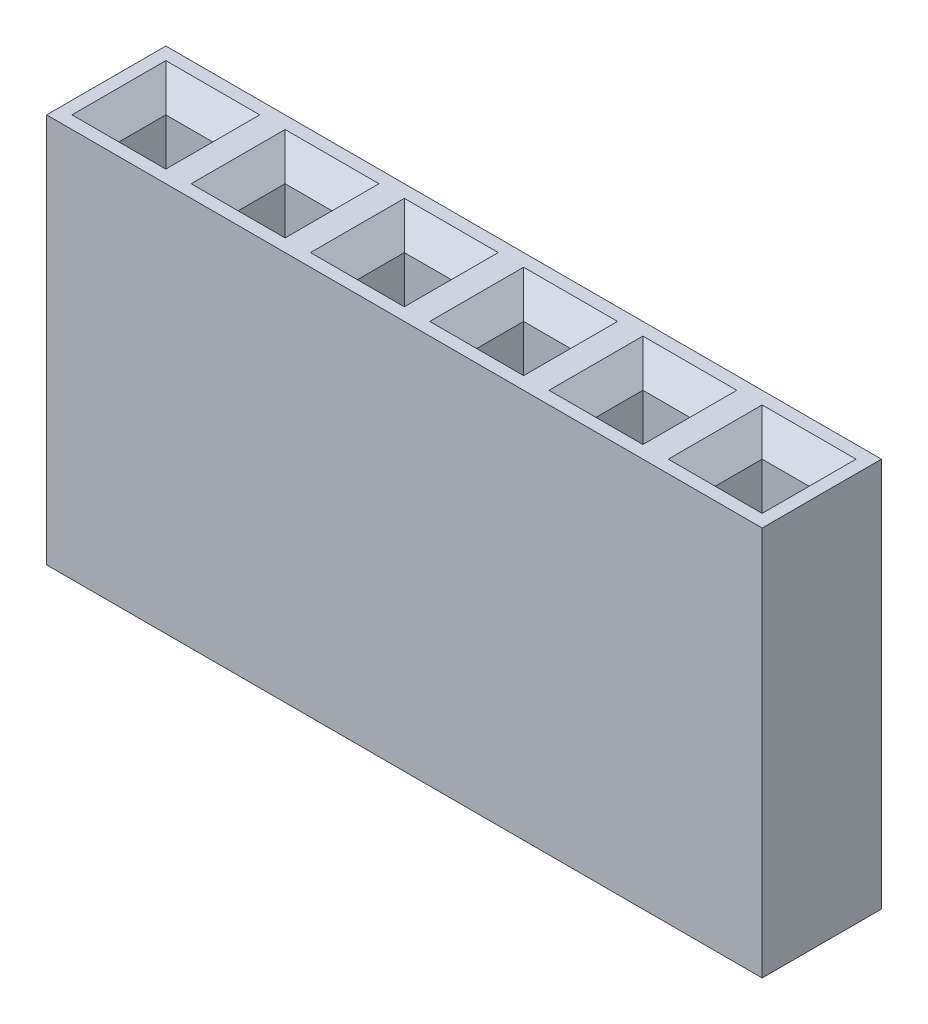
from build123d import *

# Parameters (mm, degrees)
SKETCH1_W                  = 2.54
SKETCH1_H                  = 2.54
BOSS_EXTRUDE1_DEPTH        = 8.3
SKETCH2_W                  = 1
SKETCH2_H                  = 1
CUT_EXTRUDE1_DEPTH         = 4
CHAMFER1_SIZE              = 0.5
LPATTERN1_COUNT            = 6
LPATTERN1_PITCH            = 2.54
CHAMFER1_OF_LPATTERN1_SIZE = 0.5


with BuildPart() as part:
    # Sketch1 → Boss-Extrude1 (new body)
    with BuildSketch(Plane(origin=(0, 0, 0), x_dir=(1, 0, 0), z_dir=(0, 1, 0))):
        Rectangle(SKETCH1_W, SKETCH1_H)
    boss_extrude1 = extrude(amount=BOSS_EXTRUDE1_DEPTH)

    # Sketch2 → Cut-Extrude1 (cut)
    with BuildSketch(Plane(origin=(0, 8.3, 0), x_dir=(-1, 0, 0), z_dir=(0, 1, 0))):
        Rectangle(SKETCH2_W, SKETCH2_H)
    cut_extrude1 = extrude(amount=-CUT_EXTRUDE1_DEPTH, mode=Mode.SUBTRACT)

    # Chamfer1
    chamfer1_edges = [part.edges().sort_by_distance(p)[0] for p in [
        (0, 8.3, 0.5),
        (0.5, 8.3, 0),
        (0, 8.3, -0.5),
        (-0.5, 8.3, 0),
    ]]
    chamfer(chamfer1_edges, length=CHAMFER1_SIZE)

    # LPattern1: Boss-Extrude1, Cut-Extrude1 ×6
    with Locations(*[(i * LPATTERN1_PITCH, 0, 0) for i in range(1, LPATTERN1_COUNT)]):
        add(boss_extrude1)
        add(cut_extrude1, mode=Mode.SUBTRACT)

    # Chamfer1 of LPattern1
    chamfer1_of_lpattern1_edges = [part.edges().sort_by_distance(p)[0] for p in [
        (2.54, 8.3, 0.5),
        (3.04, 8.3, 0),
        (2.54, 8.3, -0.5),
        (2.04, 8.3, 0),
        (5.08, 8.3, 0.5),
        (5.58, 8.3, 0),
        (5.08, 8.3, -0.5),
        (4.58, 8.3, 0),
        (7.62, 8.3, 0.5),
        (8.12, 8.3, 0),
        (7.62, 8.3, -0.5),
        (7.12, 8.3, 0),
        (10.16, 8.3, 0.5),
        (10.66, 8.3, 0),
        (10.16, 8.3, -0.5),
        (9.66, 8.3, 0),
        (12.7, 8.3, 0.5),
        (13.2, 8.3, 0),
        (12.7, 8.3, -0.5),
        (12.2, 8.3, 0),
    ]]
    chamfer(chamfer1_of_lpattern1_edges, length=CHAMFER1_OF_LPATTERN1_SIZE)


solid = part.part
